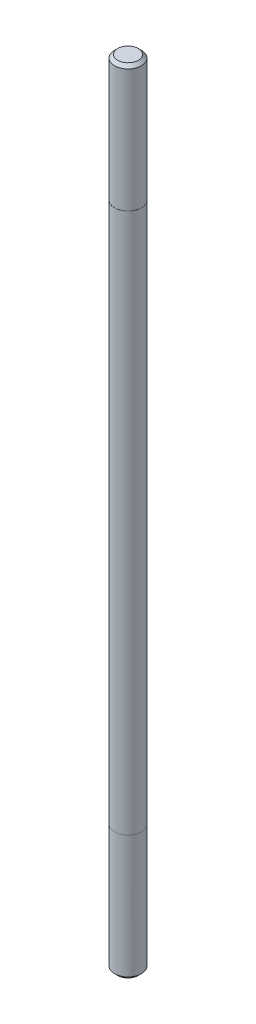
ISO-10303-21;
HEADER;
FILE_DESCRIPTION(('STEP AP214'),'2;1');
FILE_NAME('part.step','',(''),(''),'','','');
FILE_SCHEMA(('AUTOMOTIVE_DESIGN { 1 0 10303 214 1 1 1 1 }'));
ENDSEC;
DATA;
#1=APPLICATION_CONTEXT('core data for automotive mechanical design processes');
#2=APPLICATION_PROTOCOL_DEFINITION('international standard','automotive_design',2000,#1);
#3=PRODUCT_CONTEXT('',#1,'mechanical');
#4=PRODUCT('Part','Part','',(#3));
#5=PRODUCT_RELATED_PRODUCT_CATEGORY('part','',(#4));
#6=PRODUCT_DEFINITION_FORMATION('','',#4);
#7=PRODUCT_DEFINITION_CONTEXT('part definition',#1,'design');
#8=PRODUCT_DEFINITION('design','',#6,#7);
#9=PRODUCT_DEFINITION_SHAPE('','',#8);
#10=(LENGTH_UNIT() NAMED_UNIT(*) SI_UNIT(.MILLI.,.METRE.));
#11=(NAMED_UNIT(*) PLANE_ANGLE_UNIT() SI_UNIT($,.RADIAN.));
#12=(NAMED_UNIT(*) SI_UNIT($,.STERADIAN.) SOLID_ANGLE_UNIT());
#13=UNCERTAINTY_MEASURE_WITH_UNIT(LENGTH_MEASURE(1.E-05),#10,'distance_accuracy_value','');
#14=(GEOMETRIC_REPRESENTATION_CONTEXT(3) GLOBAL_UNCERTAINTY_ASSIGNED_CONTEXT((#13)) GLOBAL_UNIT_ASSIGNED_CONTEXT((#10,
#11,#12)) REPRESENTATION_CONTEXT('',''));
#15=CARTESIAN_POINT('',(0.,0.,0.));
#16=DIRECTION('',(0.,0.,1.));
#17=DIRECTION('',(1.,0.,0.));
#18=AXIS2_PLACEMENT_3D('',#15,#16,#17);
#19=CARTESIAN_POINT('',(0.,0.,0.));
#20=DIRECTION('',(0.,1.,0.));
#21=DIRECTION('',(0.,0.,1.));
#22=AXIS2_PLACEMENT_3D('',#19,#20,#21);
#23=PLANE('',#22);
#24=CARTESIAN_POINT('',(0.,0.,0.));
#25=DIRECTION('',(0.,1.,0.));
#26=DIRECTION('',(0.,0.,1.));
#27=AXIS2_PLACEMENT_3D('',#24,#25,#26);
#28=CIRCLE('',#27,1.5);
#29=CARTESIAN_POINT('',(0.,0.,1.5));
#30=VERTEX_POINT('',#29);
#31=EDGE_CURVE('E56',#30,#30,#28,.T.);
#32=ORIENTED_EDGE('',*,*,#31,.F.);
#33=EDGE_LOOP('',(#32));
#34=FACE_BOUND('',#33,.T.);
#35=CARTESIAN_POINT('',(0.,0.,0.));
#36=DIRECTION('',(0.,1.,0.));
#37=DIRECTION('',(0.,0.,1.));
#38=AXIS2_PLACEMENT_3D('',#35,#36,#37);
#39=CIRCLE('',#38,1.49);
#40=CARTESIAN_POINT('',(0.,0.,1.49));
#41=VERTEX_POINT('',#40);
#42=EDGE_CURVE('E50',#41,#41,#39,.F.);
#43=ORIENTED_EDGE('',*,*,#42,.F.);
#44=EDGE_LOOP('',(#43));
#45=FACE_BOUND('',#44,.T.);
#46=ADVANCED_FACE('F30',(#34,#45),#23,.F.);
#47=CARTESIAN_POINT('',(0.,60.,0.));
#48=DIRECTION('',(0.,1.,0.));
#49=DIRECTION('',(0.,0.,1.));
#50=AXIS2_PLACEMENT_3D('',#47,#48,#49);
#51=PLANE('',#50);
#52=CARTESIAN_POINT('',(0.,60.,0.));
#53=DIRECTION('',(0.,1.,0.));
#54=DIRECTION('',(0.,0.,1.));
#55=AXIS2_PLACEMENT_3D('',#52,#53,#54);
#56=CIRCLE('',#55,1.5);
#57=CARTESIAN_POINT('',(0.,60.,1.5));
#58=VERTEX_POINT('',#57);
#59=EDGE_CURVE('E53',#58,#58,#56,.T.);
#60=ORIENTED_EDGE('',*,*,#59,.T.);
#61=EDGE_LOOP('',(#60));
#62=FACE_BOUND('',#61,.T.);
#63=CARTESIAN_POINT('',(0.,60.,0.));
#64=DIRECTION('',(0.,1.,0.));
#65=DIRECTION('',(0.,0.,1.));
#66=AXIS2_PLACEMENT_3D('',#63,#64,#65);
#67=CIRCLE('',#66,1.49);
#68=CARTESIAN_POINT('',(0.,60.,1.49));
#69=VERTEX_POINT('',#68);
#70=EDGE_CURVE('E59',#69,#69,#67,.T.);
#71=ORIENTED_EDGE('',*,*,#70,.F.);
#72=EDGE_LOOP('',(#71));
#73=FACE_BOUND('',#72,.T.);
#74=ADVANCED_FACE('F65',(#62,#73),#51,.T.);
#75=CARTESIAN_POINT('',(0.,60.,0.));
#76=DIRECTION('',(0.,-1.,0.));
#77=DIRECTION('',(0.,0.,-1.));
#78=AXIS2_PLACEMENT_3D('',#75,#76,#77);
#79=CYLINDRICAL_SURFACE('',#78,1.5);
#80=ORIENTED_EDGE('',*,*,#59,.F.);
#81=EDGE_LOOP('',(#80));
#82=FACE_BOUND('',#81,.T.);
#83=ORIENTED_EDGE('',*,*,#31,.T.);
#84=EDGE_LOOP('',(#83));
#85=FACE_BOUND('',#84,.T.);
#86=ADVANCED_FACE('F32',(#82,#85),#79,.T.);
#87=CARTESIAN_POINT('',(0.,74.,0.));
#88=DIRECTION('',(0.,-1.,0.));
#89=DIRECTION('',(0.,0.,-1.));
#90=AXIS2_PLACEMENT_3D('',#87,#88,#89);
#91=CYLINDRICAL_SURFACE('',#90,1.49);
#92=CARTESIAN_POINT('',(0.,73.65,0.));
#93=DIRECTION('',(0.,1.,0.));
#94=DIRECTION('',(0.,0.,1.));
#95=AXIS2_PLACEMENT_3D('',#92,#93,#94);
#96=CIRCLE('',#95,1.49);
#97=CARTESIAN_POINT('',(0.,73.65,1.49));
#98=VERTEX_POINT('',#97);
#99=EDGE_CURVE('E10',#98,#98,#96,.F.);
#100=ORIENTED_EDGE('',*,*,#99,.T.);
#101=EDGE_LOOP('',(#100));
#102=FACE_BOUND('',#101,.T.);
#103=ORIENTED_EDGE('',*,*,#70,.T.);
#104=EDGE_LOOP('',(#103));
#105=FACE_BOUND('',#104,.T.);
#106=ADVANCED_FACE('F63',(#102,#105),#91,.T.);
#107=CARTESIAN_POINT('',(0.,74.,0.));
#108=DIRECTION('',(0.,1.,0.));
#109=DIRECTION('',(0.,0.,1.));
#110=AXIS2_PLACEMENT_3D('',#107,#108,#109);
#111=PLANE('',#110);
#112=CARTESIAN_POINT('',(0.,74.,0.));
#113=DIRECTION('',(0.,1.,0.));
#114=DIRECTION('',(0.,0.,1.));
#115=AXIS2_PLACEMENT_3D('',#112,#113,#114);
#116=CIRCLE('',#115,1.14);
#117=CARTESIAN_POINT('',(0.,74.,1.14));
#118=VERTEX_POINT('',#117);
#119=EDGE_CURVE('E37',#118,#118,#116,.T.);
#120=ORIENTED_EDGE('',*,*,#119,.T.);
#121=EDGE_LOOP('',(#120));
#122=FACE_BOUND('',#121,.T.);
#123=ADVANCED_FACE('F78',(#122),#111,.T.);
#124=CARTESIAN_POINT('',(0.,-14.,0.));
#125=DIRECTION('',(0.,1.,0.));
#126=DIRECTION('',(0.,0.,1.));
#127=AXIS2_PLACEMENT_3D('',#124,#125,#126);
#128=CYLINDRICAL_SURFACE('',#127,1.49);
#129=CARTESIAN_POINT('',(0.,-13.65,0.));
#130=DIRECTION('',(0.,-1.,0.));
#131=DIRECTION('',(0.,0.,-1.));
#132=AXIS2_PLACEMENT_3D('',#129,#130,#131);
#133=CIRCLE('',#132,1.49);
#134=CARTESIAN_POINT('',(0.,-13.65,-1.49));
#135=VERTEX_POINT('',#134);
#136=EDGE_CURVE('E41',#135,#135,#133,.F.);
#137=ORIENTED_EDGE('',*,*,#136,.T.);
#138=EDGE_LOOP('',(#137));
#139=FACE_BOUND('',#138,.T.);
#140=ORIENTED_EDGE('',*,*,#42,.T.);
#141=EDGE_LOOP('',(#140));
#142=FACE_BOUND('',#141,.T.);
#143=ADVANCED_FACE('F81',(#139,#142),#128,.T.);
#144=CARTESIAN_POINT('',(0.,-14.,0.));
#145=DIRECTION('',(0.,-1.,0.));
#146=DIRECTION('',(0.,0.,-1.));
#147=AXIS2_PLACEMENT_3D('',#144,#145,#146);
#148=PLANE('',#147);
#149=CARTESIAN_POINT('',(0.,-14.,0.));
#150=DIRECTION('',(0.,-1.,0.));
#151=DIRECTION('',(0.,0.,-1.));
#152=AXIS2_PLACEMENT_3D('',#149,#150,#151);
#153=CIRCLE('',#152,1.14);
#154=CARTESIAN_POINT('',(0.,-14.,-1.14));
#155=VERTEX_POINT('',#154);
#156=EDGE_CURVE('E45',#155,#155,#153,.T.);
#157=ORIENTED_EDGE('',*,*,#156,.T.);
#158=EDGE_LOOP('',(#157));
#159=FACE_BOUND('',#158,.T.);
#160=ADVANCED_FACE('F84',(#159),#148,.T.);
#161=CARTESIAN_POINT('',(0.,-14.,0.));
#162=DIRECTION('',(0.,1.,0.));
#163=DIRECTION('',(0.,0.,1.));
#164=AXIS2_PLACEMENT_3D('',#161,#162,#163);
#165=CONICAL_SURFACE('',#164,1.14,0.785398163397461);
#166=ORIENTED_EDGE('',*,*,#136,.F.);
#167=EDGE_LOOP('',(#166));
#168=FACE_BOUND('',#167,.T.);
#169=ORIENTED_EDGE('',*,*,#156,.F.);
#170=EDGE_LOOP('',(#169));
#171=FACE_BOUND('',#170,.T.);
#172=ADVANCED_FACE('F88',(#168,#171),#165,.T.);
#173=CARTESIAN_POINT('',(0.,74.,0.));
#174=DIRECTION('',(0.,-1.,0.));
#175=DIRECTION('',(0.,0.,-1.));
#176=AXIS2_PLACEMENT_3D('',#173,#174,#175);
#177=CONICAL_SURFACE('',#176,1.14,0.785398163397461);
#178=ORIENTED_EDGE('',*,*,#99,.F.);
#179=EDGE_LOOP('',(#178));
#180=FACE_BOUND('',#179,.T.);
#181=ORIENTED_EDGE('',*,*,#119,.F.);
#182=EDGE_LOOP('',(#181));
#183=FACE_BOUND('',#182,.T.);
#184=ADVANCED_FACE('F92',(#180,#183),#177,.T.);
#185=CLOSED_SHELL('',(#46,#74,#86,#106,#123,#143,#160,#172,#184));
#186=MANIFOLD_SOLID_BREP('B2',#185);
#187=ADVANCED_BREP_SHAPE_REPRESENTATION('',(#18,#186),#14);
#188=SHAPE_DEFINITION_REPRESENTATION(#9,#187);
ENDSEC;
END-ISO-10303-21;
